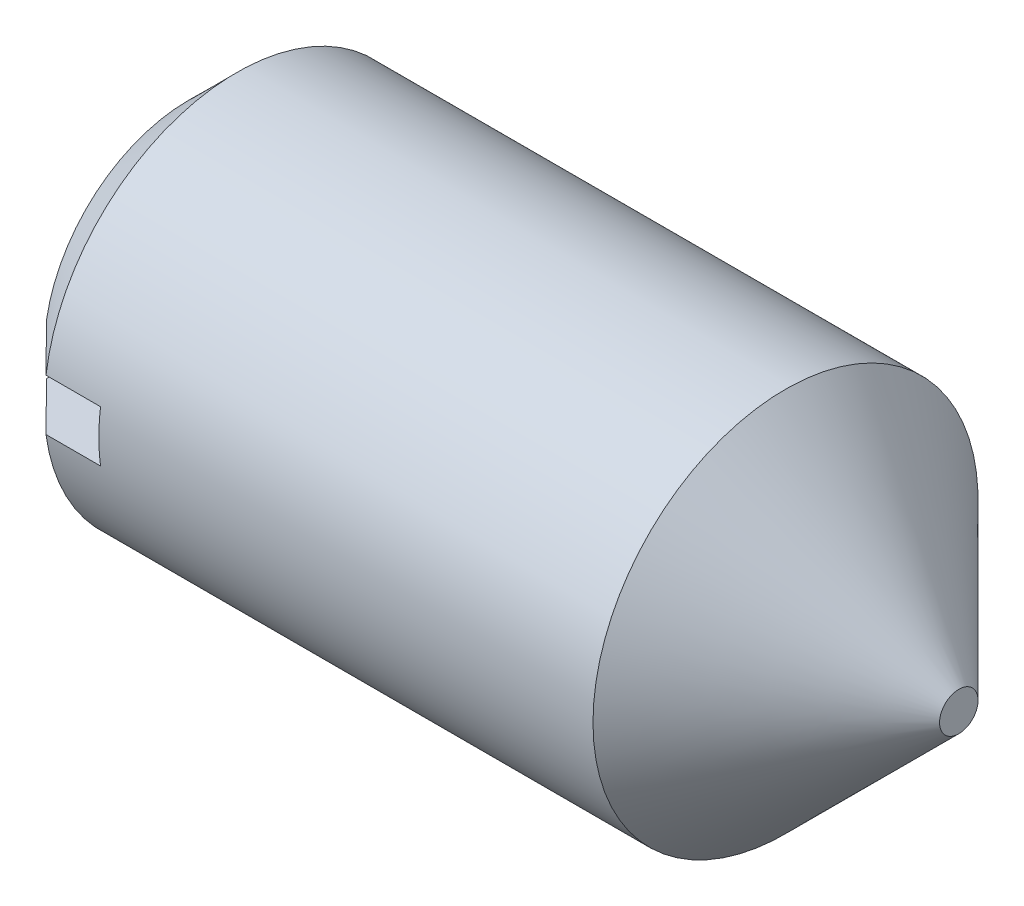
from build123d import *

# Parameters (mm, degrees)
NOTCH_DEPTH      = 7.363961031
NOTCH_DEPTH_BACK = 7.363961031
SKETCH2_W        = 0.8
SKETCH2_H        = 0.4


with BuildPart() as part:
    # Sketch1 → Base (revolve)
    with BuildSketch(Plane.XY, mode=Mode.PRIVATE) as base_sk:
        Polygon((0, 0), (6, 0), (6, 0.15), (4.65, 1.5), (0.375, 1.5), (0, 1.125), align=None)
    revolve(base_sk.sketch.rotate(Axis((-14.774129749, 0, 0), (1, 0, 0)), 90), axis=Axis((-14.774129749, 0, 0), (1, 0, 0)))

    # Sketch2 → Notch (cut, two sides: drawn at the far end of the back side and taken through both)
    with BuildSketch(Plane.XY.offset(-NOTCH_DEPTH_BACK)):
        with Locations((0.4, 0)):
            Rectangle(SKETCH2_W, SKETCH2_H)
    extrude(amount=NOTCH_DEPTH + NOTCH_DEPTH_BACK, mode=Mode.SUBTRACT)


solid = part.part
